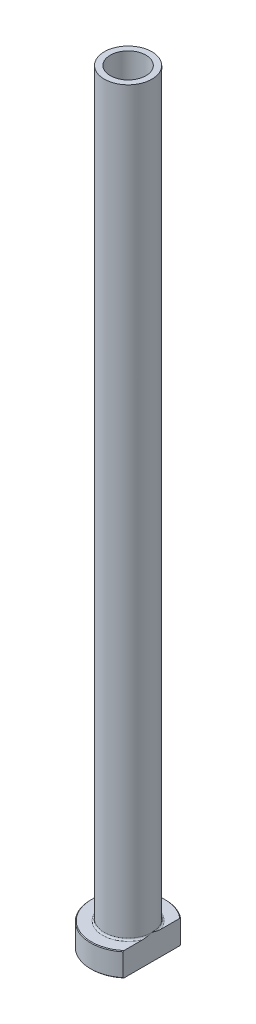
from build123d import *

# Parameters (mm, degrees)
FILLET1_R          = 0.5
CHAMFER1_SIZE      = 0.2
CUT_EXTRUDE1_DEPTH = 226.537136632
CHAMFER2_SIZE      = 0.5


with BuildPart() as part:
    # Sketch1 → Revolve1 (revolve)
    with BuildSketch(Plane.XY, mode=Mode.PRIVATE) as revolve1_sk:
        Polygon((-5.25, 225), (-7, 225), (-7, 7), (-11, 7), (-11, 0), (-5.5, 0), (-5.5, 158), (-5.25, 170), align=None)
    revolve(revolve1_sk.sketch.rotate(Axis((0, 92.187680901, 0), (0, -1, 0)), 270), axis=Axis((0, 92.187680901, 0), (0, -1, 0)))

    # Fillet1
    fillet1_edges = [part.edges().sort_by_distance(p)[0] for p in [
        (0, 7, -7),
    ]]
    fillet(fillet1_edges, radius=FILLET1_R)

    # Chamfer1
    chamfer1_edges = [part.edges().sort_by_distance(p)[0] for p in [
        (0, 0, -11),
        (0, 7, -11),
    ]]
    chamfer(chamfer1_edges, length=CHAMFER1_SIZE)

    # Sketch2 → Cut-Extrude1 (cut, through all)
    with BuildSketch(Plane.XZ):
        with BuildLine():
            Line((7, 8.485281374), (7, -8.485281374))
            ThreePointArc((7, -8.485281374), (11, 0), (7, 8.485281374))
        make_face()
    extrude(amount=-CUT_EXTRUDE1_DEPTH, mode=Mode.SUBTRACT)

    # Chamfer2
    chamfer2_edges = [part.edges().sort_by_distance(p)[0] for p in [
        (0, 0, -5.5),
    ]]
    chamfer(chamfer2_edges, length=CHAMFER2_SIZE)


solid = part.part
